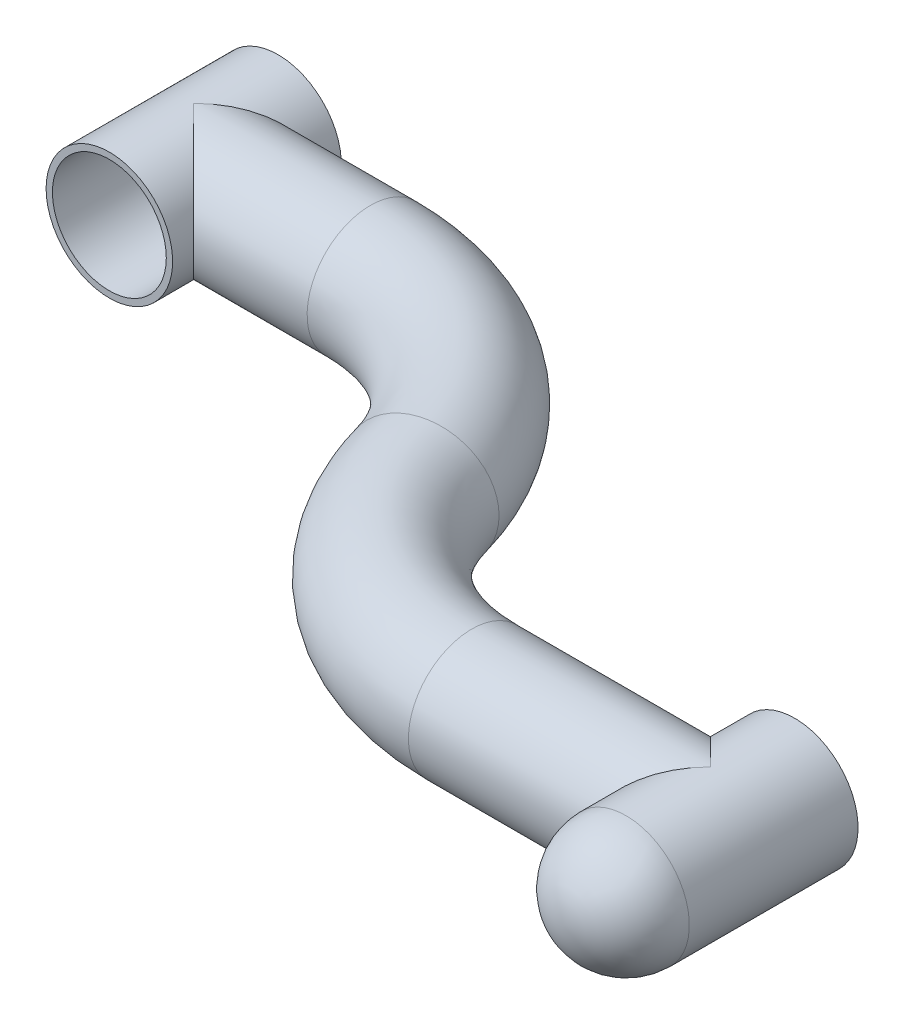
ISO-10303-21;
HEADER;
FILE_DESCRIPTION(('STEP AP214'),'2;1');
FILE_NAME('part.step','',(''),(''),'','','');
FILE_SCHEMA(('AUTOMOTIVE_DESIGN { 1 0 10303 214 1 1 1 1 }'));
ENDSEC;
DATA;
#1=APPLICATION_CONTEXT('core data for automotive mechanical design processes');
#2=APPLICATION_PROTOCOL_DEFINITION('international standard','automotive_design',2000,#1);
#3=PRODUCT_CONTEXT('',#1,'mechanical');
#4=PRODUCT('Part','Part','',(#3));
#5=PRODUCT_RELATED_PRODUCT_CATEGORY('part','',(#4));
#6=PRODUCT_DEFINITION_FORMATION('','',#4);
#7=PRODUCT_DEFINITION_CONTEXT('part definition',#1,'design');
#8=PRODUCT_DEFINITION('design','',#6,#7);
#9=PRODUCT_DEFINITION_SHAPE('','',#8);
#10=(LENGTH_UNIT() NAMED_UNIT(*) SI_UNIT(.MILLI.,.METRE.));
#11=(NAMED_UNIT(*) PLANE_ANGLE_UNIT() SI_UNIT($,.RADIAN.));
#12=(NAMED_UNIT(*) SI_UNIT($,.STERADIAN.) SOLID_ANGLE_UNIT());
#13=UNCERTAINTY_MEASURE_WITH_UNIT(LENGTH_MEASURE(1.E-05),#10,'distance_accuracy_value','');
#14=(GEOMETRIC_REPRESENTATION_CONTEXT(3) GLOBAL_UNCERTAINTY_ASSIGNED_CONTEXT((#13)) GLOBAL_UNIT_ASSIGNED_CONTEXT((#10,
#11,#12)) REPRESENTATION_CONTEXT('',''));
#15=CARTESIAN_POINT('',(0.,0.,0.));
#16=DIRECTION('',(0.,0.,1.));
#17=DIRECTION('',(1.,0.,0.));
#18=AXIS2_PLACEMENT_3D('',#15,#16,#17);
#19=CARTESIAN_POINT('',(-113.203482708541,0.,0.));
#20=DIRECTION('',(1.,0.,0.));
#21=DIRECTION('',(0.,0.,-1.));
#22=AXIS2_PLACEMENT_3D('',#19,#20,#21);
#23=CYLINDRICAL_SURFACE('',#22,30.);
#24=CARTESIAN_POINT('',(-113.203482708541,0.,0.));
#25=DIRECTION('',(1.,0.,0.));
#26=DIRECTION('',(0.,0.,-1.));
#27=AXIS2_PLACEMENT_3D('',#24,#25,#26);
#28=CIRCLE('',#27,30.);
#29=CARTESIAN_POINT('',(-113.203482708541,0.,-30.));
#30=VERTEX_POINT('',#29);
#31=EDGE_CURVE('E109',#30,#30,#28,.T.);
#32=ORIENTED_EDGE('',*,*,#31,.T.);
#33=EDGE_LOOP('',(#32));
#34=FACE_BOUND('',#33,.T.);
#35=CARTESIAN_POINT('',(0.,0.,0.));
#36=DIRECTION('',(0.707106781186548,0.,0.707106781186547));
#37=DIRECTION('',(0.707106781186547,0.,-0.707106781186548));
#38=AXIS2_PLACEMENT_3D('',#35,#36,#37);
#39=ELLIPSE('',#38,42.4264068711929,30.);
#40=CARTESIAN_POINT('',(0.,-30.,0.));
#41=VERTEX_POINT('',#40);
#42=CARTESIAN_POINT('',(0.,30.,0.));
#43=VERTEX_POINT('',#42);
#44=EDGE_CURVE('E75',#41,#43,#39,.F.);
#45=ORIENTED_EDGE('',*,*,#44,.T.);
#46=CARTESIAN_POINT('',(0.,0.,0.));
#47=DIRECTION('',(0.707106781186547,0.,-0.707106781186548));
#48=DIRECTION('',(0.707106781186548,0.,0.707106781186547));
#49=AXIS2_PLACEMENT_3D('',#46,#47,#48);
#50=ELLIPSE('',#49,42.4264068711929,30.);
#51=EDGE_CURVE('E62',#43,#41,#50,.F.);
#52=ORIENTED_EDGE('',*,*,#51,.T.);
#53=EDGE_LOOP('',(#45,#52));
#54=FACE_BOUND('',#53,.T.);
#55=ADVANCED_FACE('F38',(#34,#54),#23,.T.);
#56=CARTESIAN_POINT('',(-311.22362176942,0.,-150.));
#57=DIRECTION('',(-1.,0.,0.));
#58=DIRECTION('',(0.,0.,1.));
#59=AXIS2_PLACEMENT_3D('',#56,#57,#58);
#60=CYLINDRICAL_SURFACE('',#59,30.);
#61=CARTESIAN_POINT('',(-311.22362176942,0.,-150.));
#62=DIRECTION('',(1.,0.,0.));
#63=DIRECTION('',(0.,0.,-1.));
#64=AXIS2_PLACEMENT_3D('',#61,#62,#63);
#65=CIRCLE('',#64,30.);
#66=CARTESIAN_POINT('',(-311.22362176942,0.,-180.));
#67=VERTEX_POINT('',#66);
#68=EDGE_CURVE('E42',#67,#67,#65,.T.);
#69=ORIENTED_EDGE('',*,*,#68,.F.);
#70=EDGE_LOOP('',(#69));
#71=FACE_BOUND('',#70,.T.);
#72=CARTESIAN_POINT('',(-395.,0.,-150.));
#73=DIRECTION('',(-0.707106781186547,0.,0.707106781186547));
#74=DIRECTION('',(-0.707106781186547,0.,-0.707106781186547));
#75=AXIS2_PLACEMENT_3D('',#72,#73,#74);
#76=ELLIPSE('',#75,42.4264068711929,30.);
#77=CARTESIAN_POINT('',(-395.,30.,-150.));
#78=VERTEX_POINT('',#77);
#79=CARTESIAN_POINT('',(-395.,-30.,-150.));
#80=VERTEX_POINT('',#79);
#81=EDGE_CURVE('E67',#78,#80,#76,.F.);
#82=ORIENTED_EDGE('',*,*,#81,.T.);
#83=CARTESIAN_POINT('',(-395.,0.,-150.));
#84=DIRECTION('',(-0.707106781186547,0.,-0.707106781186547));
#85=DIRECTION('',(-0.707106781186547,0.,0.707106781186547));
#86=AXIS2_PLACEMENT_3D('',#83,#84,#85);
#87=ELLIPSE('',#86,42.4264068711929,30.);
#88=EDGE_CURVE('E55',#80,#78,#87,.F.);
#89=ORIENTED_EDGE('',*,*,#88,.T.);
#90=EDGE_LOOP('',(#82,#89));
#91=FACE_BOUND('',#90,.T.);
#92=ADVANCED_FACE('F40',(#71,#91),#60,.T.);
#93=CARTESIAN_POINT('',(-311.22362176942,0.,-47.14670754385));
#94=DIRECTION('',(0.,1.,0.));
#95=DIRECTION('',(0.,0.,1.));
#96=AXIS2_PLACEMENT_3D('',#93,#94,#95);
#97=TOROIDAL_SURFACE('',#96,102.85329245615,30.);
#98=CARTESIAN_POINT('',(-212.213552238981,0.,-74.9999999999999));
#99=DIRECTION('',(0.270806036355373,0.,0.962633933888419));
#100=DIRECTION('',(0.962633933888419,0.,-0.270806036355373));
#101=AXIS2_PLACEMENT_3D('',#98,#99,#100);
#102=CIRCLE('',#101,30.);
#103=CARTESIAN_POINT('',(-183.334534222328,0.,-83.1241810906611));
#104=VERTEX_POINT('',#103);
#105=EDGE_CURVE('E315',#104,#104,#102,.T.);
#106=CARTESIAN_POINT('',(-311.22362176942,0.,-47.14670754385));
#107=DIRECTION('',(0.,1.,0.));
#108=DIRECTION('',(0.,0.,1.));
#109=AXIS2_PLACEMENT_3D('',#106,#107,#108);
#110=CIRCLE('',#109,132.85329245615);
#111=EDGE_CURVE('',#104,#67,#110,.T.);
#112=ORIENTED_EDGE('',*,*,#105,.F.);
#113=ORIENTED_EDGE('',*,*,#68,.T.);
#114=ORIENTED_EDGE('',*,*,#111,.T.);
#115=ORIENTED_EDGE('',*,*,#111,.F.);
#116=EDGE_LOOP('',(#112,#114,#113,#115));
#117=FACE_BOUND('',#116,.T.);
#118=ADVANCED_FACE('F104',(#117),#97,.T.);
#119=CARTESIAN_POINT('',(-113.203482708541,0.,-102.85329245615));
#120=DIRECTION('',(0.,-1.,0.));
#121=DIRECTION('',(0.,0.,-1.));
#122=AXIS2_PLACEMENT_3D('',#119,#120,#121);
#123=TOROIDAL_SURFACE('',#122,102.85329245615,30.);
#124=ORIENTED_EDGE('',*,*,#31,.F.);
#125=EDGE_LOOP('',(#124));
#126=FACE_BOUND('',#125,.T.);
#127=ORIENTED_EDGE('',*,*,#105,.T.);
#128=EDGE_LOOP('',(#127));
#129=FACE_BOUND('',#128,.T.);
#130=ADVANCED_FACE('F238',(#126,#129),#123,.T.);
#131=CARTESIAN_POINT('',(0.,0.,-40.));
#132=DIRECTION('',(0.,0.,1.));
#133=DIRECTION('',(1.,0.,0.));
#134=AXIS2_PLACEMENT_3D('',#131,#132,#133);
#135=PLANE('',#134);
#136=CARTESIAN_POINT('',(0.,0.,-40.));
#137=DIRECTION('',(0.,0.,1.));
#138=DIRECTION('',(1.,0.,0.));
#139=AXIS2_PLACEMENT_3D('',#136,#137,#138);
#140=CIRCLE('',#139,27.);
#141=CARTESIAN_POINT('',(27.,0.,-40.));
#142=VERTEX_POINT('',#141);
#143=EDGE_CURVE('E128',#142,#142,#140,.T.);
#144=ORIENTED_EDGE('',*,*,#143,.T.);
#145=EDGE_LOOP('',(#144));
#146=FACE_BOUND('',#145,.T.);
#147=CARTESIAN_POINT('',(0.,0.,-40.));
#148=DIRECTION('',(0.,0.,-1.));
#149=DIRECTION('',(-1.,0.,0.));
#150=AXIS2_PLACEMENT_3D('',#147,#148,#149);
#151=CIRCLE('',#150,30.);
#152=CARTESIAN_POINT('',(-30.,0.,-40.));
#153=VERTEX_POINT('',#152);
#154=EDGE_CURVE('E72',#153,#153,#151,.T.);
#155=ORIENTED_EDGE('',*,*,#154,.T.);
#156=EDGE_LOOP('',(#155));
#157=FACE_BOUND('',#156,.T.);
#158=ADVANCED_FACE('F96',(#146,#157),#135,.F.);
#159=CARTESIAN_POINT('',(0.,0.,-40.));
#160=DIRECTION('',(0.,0.,-1.));
#161=DIRECTION('',(-1.,0.,0.));
#162=AXIS2_PLACEMENT_3D('',#159,#160,#161);
#163=CYLINDRICAL_SURFACE('',#162,30.);
#164=ORIENTED_EDGE('',*,*,#51,.F.);
#165=ORIENTED_EDGE('',*,*,#44,.F.);
#166=EDGE_LOOP('',(#164,#165));
#167=FACE_BOUND('',#166,.T.);
#168=ORIENTED_EDGE('',*,*,#154,.F.);
#169=EDGE_LOOP('',(#168));
#170=FACE_BOUND('',#169,.T.);
#171=CARTESIAN_POINT('',(0.,0.,40.));
#172=DIRECTION('',(0.,0.,-1.));
#173=DIRECTION('',(-1.,0.,0.));
#174=AXIS2_PLACEMENT_3D('',#171,#172,#173);
#175=CIRCLE('',#174,30.);
#176=CARTESIAN_POINT('',(-30.,0.,40.));
#177=VERTEX_POINT('',#176);
#178=EDGE_CURVE('E115',#177,#177,#175,.T.);
#179=ORIENTED_EDGE('',*,*,#178,.T.);
#180=EDGE_LOOP('',(#179));
#181=FACE_BOUND('',#180,.T.);
#182=ADVANCED_FACE('F92',(#167,#170,#181),#163,.T.);
#183=CARTESIAN_POINT('',(-395.,0.,-190.));
#184=DIRECTION('',(0.,0.,-1.));
#185=DIRECTION('',(-1.,0.,0.));
#186=AXIS2_PLACEMENT_3D('',#183,#184,#185);
#187=CYLINDRICAL_SURFACE('',#186,30.);
#188=CARTESIAN_POINT('',(-395.,0.,-110.));
#189=DIRECTION('',(0.,0.,-1.));
#190=DIRECTION('',(-1.,0.,0.));
#191=AXIS2_PLACEMENT_3D('',#188,#189,#190);
#192=CIRCLE('',#191,30.);
#193=CARTESIAN_POINT('',(-425.,0.,-110.));
#194=VERTEX_POINT('',#193);
#195=EDGE_CURVE('E70',#194,#194,#192,.T.);
#196=ORIENTED_EDGE('',*,*,#195,.T.);
#197=EDGE_LOOP('',(#196));
#198=FACE_BOUND('',#197,.T.);
#199=CARTESIAN_POINT('',(-395.,0.,-190.));
#200=DIRECTION('',(0.,0.,-1.));
#201=DIRECTION('',(-1.,0.,0.));
#202=AXIS2_PLACEMENT_3D('',#199,#200,#201);
#203=CIRCLE('',#202,30.);
#204=CARTESIAN_POINT('',(-425.,0.,-190.));
#205=VERTEX_POINT('',#204);
#206=EDGE_CURVE('E131',#205,#205,#203,.T.);
#207=ORIENTED_EDGE('',*,*,#206,.F.);
#208=EDGE_LOOP('',(#207));
#209=FACE_BOUND('',#208,.T.);
#210=ORIENTED_EDGE('',*,*,#88,.F.);
#211=ORIENTED_EDGE('',*,*,#81,.F.);
#212=EDGE_LOOP('',(#210,#211));
#213=FACE_BOUND('',#212,.T.);
#214=ADVANCED_FACE('F68',(#198,#209,#213),#187,.T.);
#215=CARTESIAN_POINT('',(-395.,0.,-110.));
#216=DIRECTION('',(0.,0.,1.));
#217=DIRECTION('',(1.,0.,0.));
#218=AXIS2_PLACEMENT_3D('',#215,#216,#217);
#219=PLANE('',#218);
#220=CARTESIAN_POINT('',(-395.,0.,-110.));
#221=DIRECTION('',(0.,0.,1.));
#222=DIRECTION('',(1.,0.,0.));
#223=AXIS2_PLACEMENT_3D('',#220,#221,#222);
#224=CIRCLE('',#223,27.);
#225=CARTESIAN_POINT('',(-368.,0.,-110.));
#226=VERTEX_POINT('',#225);
#227=EDGE_CURVE('E125',#226,#226,#224,.T.);
#228=ORIENTED_EDGE('',*,*,#227,.F.);
#229=EDGE_LOOP('',(#228));
#230=FACE_BOUND('',#229,.T.);
#231=ORIENTED_EDGE('',*,*,#195,.F.);
#232=EDGE_LOOP('',(#231));
#233=FACE_BOUND('',#232,.T.);
#234=ADVANCED_FACE('F149',(#230,#233),#219,.T.);
#235=CARTESIAN_POINT('',(-395.,0.,-190.));
#236=DIRECTION('',(0.,0.,-1.));
#237=DIRECTION('',(-1.,0.,0.));
#238=AXIS2_PLACEMENT_3D('',#235,#236,#237);
#239=PLANE('',#238);
#240=CARTESIAN_POINT('',(-395.,0.,-190.));
#241=DIRECTION('',(0.,0.,1.));
#242=DIRECTION('',(1.,0.,0.));
#243=AXIS2_PLACEMENT_3D('',#240,#241,#242);
#244=CIRCLE('',#243,27.);
#245=CARTESIAN_POINT('',(-368.,0.,-190.));
#246=VERTEX_POINT('',#245);
#247=EDGE_CURVE('E120',#246,#246,#244,.T.);
#248=ORIENTED_EDGE('',*,*,#247,.T.);
#249=EDGE_LOOP('',(#248));
#250=FACE_BOUND('',#249,.T.);
#251=ORIENTED_EDGE('',*,*,#206,.T.);
#252=EDGE_LOOP('',(#251));
#253=FACE_BOUND('',#252,.T.);
#254=ADVANCED_FACE('F147',(#250,#253),#239,.T.);
#255=CARTESIAN_POINT('',(0.,0.,-190.));
#256=DIRECTION('',(0.,0.,1.));
#257=DIRECTION('',(1.,0.,0.));
#258=AXIS2_PLACEMENT_3D('',#255,#256,#257);
#259=CYLINDRICAL_SURFACE('',#258,27.);
#260=CARTESIAN_POINT('',(0.,0.,40.));
#261=DIRECTION('',(0.,0.,-1.));
#262=DIRECTION('',(-1.,0.,0.));
#263=AXIS2_PLACEMENT_3D('',#260,#261,#262);
#264=CIRCLE('',#263,27.);
#265=CARTESIAN_POINT('',(27.,0.,40.));
#266=VERTEX_POINT('',#265);
#267=EDGE_CURVE('E117',#266,#266,#264,.F.);
#268=CARTESIAN_POINT('',(27.,0.,40.));
#269=CARTESIAN_POINT('',(27.,0.,39.1666666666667));
#270=CARTESIAN_POINT('',(27.,0.,38.3333333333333));
#271=CARTESIAN_POINT('',(27.,0.,36.6666666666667));
#272=CARTESIAN_POINT('',(27.,0.,35.8333333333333));
#273=CARTESIAN_POINT('',(27.,0.,34.1666666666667));
#274=CARTESIAN_POINT('',(27.,0.,33.3333333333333));
#275=CARTESIAN_POINT('',(27.,0.,31.6666666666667));
#276=CARTESIAN_POINT('',(27.,0.,30.8333333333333));
#277=CARTESIAN_POINT('',(27.,0.,29.1666666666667));
#278=CARTESIAN_POINT('',(27.,0.,28.3333333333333));
#279=CARTESIAN_POINT('',(27.,0.,26.6666666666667));
#280=CARTESIAN_POINT('',(27.,0.,25.8333333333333));
#281=CARTESIAN_POINT('',(27.,0.,24.1666666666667));
#282=CARTESIAN_POINT('',(27.,0.,23.3333333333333));
#283=CARTESIAN_POINT('',(27.,0.,21.6666666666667));
#284=CARTESIAN_POINT('',(27.,0.,20.8333333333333));
#285=CARTESIAN_POINT('',(27.,0.,19.1666666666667));
#286=CARTESIAN_POINT('',(27.,0.,18.3333333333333));
#287=CARTESIAN_POINT('',(27.,0.,16.6666666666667));
#288=CARTESIAN_POINT('',(27.,0.,15.8333333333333));
#289=CARTESIAN_POINT('',(27.,0.,14.1666666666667));
#290=CARTESIAN_POINT('',(27.,0.,13.3333333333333));
#291=CARTESIAN_POINT('',(27.,0.,11.6666666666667));
#292=CARTESIAN_POINT('',(27.,0.,10.8333333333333));
#293=CARTESIAN_POINT('',(27.,0.,9.16666666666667));
#294=CARTESIAN_POINT('',(27.,0.,8.33333333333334));
#295=CARTESIAN_POINT('',(27.,0.,6.66666666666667));
#296=CARTESIAN_POINT('',(27.,0.,5.83333333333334));
#297=CARTESIAN_POINT('',(27.,0.,4.16666666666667));
#298=CARTESIAN_POINT('',(27.,0.,3.33333333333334));
#299=CARTESIAN_POINT('',(27.,0.,1.66666666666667));
#300=CARTESIAN_POINT('',(27.,0.,0.833333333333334));
#301=CARTESIAN_POINT('',(27.,0.,-0.833333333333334));
#302=CARTESIAN_POINT('',(27.,0.,-1.66666666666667));
#303=CARTESIAN_POINT('',(27.,0.,-3.33333333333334));
#304=CARTESIAN_POINT('',(27.,0.,-4.16666666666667));
#305=CARTESIAN_POINT('',(27.,0.,-5.83333333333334));
#306=CARTESIAN_POINT('',(27.,0.,-6.66666666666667));
#307=CARTESIAN_POINT('',(27.,0.,-8.33333333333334));
#308=CARTESIAN_POINT('',(27.,0.,-9.16666666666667));
#309=CARTESIAN_POINT('',(27.,0.,-10.8333333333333));
#310=CARTESIAN_POINT('',(27.,0.,-11.6666666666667));
#311=CARTESIAN_POINT('',(27.,0.,-13.3333333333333));
#312=CARTESIAN_POINT('',(27.,0.,-14.1666666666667));
#313=CARTESIAN_POINT('',(27.,0.,-15.8333333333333));
#314=CARTESIAN_POINT('',(27.,0.,-16.6666666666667));
#315=CARTESIAN_POINT('',(27.,0.,-18.3333333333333));
#316=CARTESIAN_POINT('',(27.,0.,-19.1666666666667));
#317=CARTESIAN_POINT('',(27.,0.,-20.8333333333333));
#318=CARTESIAN_POINT('',(27.,0.,-21.6666666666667));
#319=CARTESIAN_POINT('',(27.,0.,-23.3333333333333));
#320=CARTESIAN_POINT('',(27.,0.,-24.1666666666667));
#321=CARTESIAN_POINT('',(27.,0.,-25.8333333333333));
#322=CARTESIAN_POINT('',(27.,0.,-26.6666666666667));
#323=CARTESIAN_POINT('',(27.,0.,-28.3333333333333));
#324=CARTESIAN_POINT('',(27.,0.,-29.1666666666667));
#325=CARTESIAN_POINT('',(27.,0.,-30.8333333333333));
#326=CARTESIAN_POINT('',(27.,0.,-31.6666666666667));
#327=CARTESIAN_POINT('',(27.,0.,-33.3333333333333));
#328=CARTESIAN_POINT('',(27.,0.,-34.1666666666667));
#329=CARTESIAN_POINT('',(27.,0.,-35.8333333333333));
#330=CARTESIAN_POINT('',(27.,0.,-36.6666666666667));
#331=CARTESIAN_POINT('',(27.,0.,-38.3333333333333));
#332=CARTESIAN_POINT('',(27.,0.,-39.1666666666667));
#333=CARTESIAN_POINT('',(27.,0.,-40.));
#334=B_SPLINE_CURVE_WITH_KNOTS('',3,(#268,#269,#270,#271,#272,#273,#274,#275,#276,#277,#278,
#279,#280,#281,#282,#283,#284,#285,#286,#287,#288,#289,#290,#291,#292,#293,#294,#295,#296,#297,
#298,#299,#300,#301,#302,#303,#304,#305,#306,#307,#308,#309,#310,#311,#312,#313,#314,#315,#316,
#317,#318,#319,#320,#321,#322,#323,#324,#325,#326,#327,#328,#329,#330,#331,#332,#333),
.UNSPECIFIED.,.F.,.F.,(4,2,2,2,2,2,2,2,2,2,2,2,2,2,2,2,2,2,2,2,2,2,2,2,2,2,2,2,2,2,2,2,4),(0.,
2.5,5.,7.50000000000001,10.,12.5,15.,17.5,20.,22.5,25.,27.5,30.,32.5,35.,37.5,40.,42.5,45.,47.5,
50.,52.5,55.,57.5,60.,62.5,65.,67.5,70.,72.5,75.,77.5,80.),.UNSPECIFIED.);
#335=EDGE_CURVE('BSEAM156',#266,#142,#334,.T.);
#336=ORIENTED_EDGE('',*,*,#267,.T.);
#337=ORIENTED_EDGE('',*,*,#143,.F.);
#338=ORIENTED_EDGE('',*,*,#335,.T.);
#339=ORIENTED_EDGE('',*,*,#335,.F.);
#340=EDGE_LOOP('',(#336,#338,#337,#339));
#341=FACE_BOUND('',#340,.T.);
#342=ADVANCED_FACE('F156',(#341),#259,.F.);
#343=CARTESIAN_POINT('',(-395.,0.,-190.));
#344=DIRECTION('',(0.,0.,1.));
#345=DIRECTION('',(1.,0.,0.));
#346=AXIS2_PLACEMENT_3D('',#343,#344,#345);
#347=CYLINDRICAL_SURFACE('',#346,27.);
#348=CARTESIAN_POINT('',(-368.,0.,-110.));
#349=CARTESIAN_POINT('',(-368.,0.,-110.833333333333));
#350=CARTESIAN_POINT('',(-368.,0.,-111.666666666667));
#351=CARTESIAN_POINT('',(-368.,0.,-113.333333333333));
#352=CARTESIAN_POINT('',(-368.,0.,-114.166666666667));
#353=CARTESIAN_POINT('',(-368.,0.,-115.833333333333));
#354=CARTESIAN_POINT('',(-368.,0.,-116.666666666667));
#355=CARTESIAN_POINT('',(-368.,0.,-118.333333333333));
#356=CARTESIAN_POINT('',(-368.,0.,-119.166666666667));
#357=CARTESIAN_POINT('',(-368.,0.,-120.833333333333));
#358=CARTESIAN_POINT('',(-368.,0.,-121.666666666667));
#359=CARTESIAN_POINT('',(-368.,0.,-123.333333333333));
#360=CARTESIAN_POINT('',(-368.,0.,-124.166666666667));
#361=CARTESIAN_POINT('',(-368.,0.,-125.833333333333));
#362=CARTESIAN_POINT('',(-368.,0.,-126.666666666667));
#363=CARTESIAN_POINT('',(-368.,0.,-128.333333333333));
#364=CARTESIAN_POINT('',(-368.,0.,-129.166666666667));
#365=CARTESIAN_POINT('',(-368.,0.,-130.833333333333));
#366=CARTESIAN_POINT('',(-368.,0.,-131.666666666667));
#367=CARTESIAN_POINT('',(-368.,0.,-133.333333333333));
#368=CARTESIAN_POINT('',(-368.,0.,-134.166666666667));
#369=CARTESIAN_POINT('',(-368.,0.,-135.833333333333));
#370=CARTESIAN_POINT('',(-368.,0.,-136.666666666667));
#371=CARTESIAN_POINT('',(-368.,0.,-138.333333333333));
#372=CARTESIAN_POINT('',(-368.,0.,-139.166666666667));
#373=CARTESIAN_POINT('',(-368.,0.,-140.833333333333));
#374=CARTESIAN_POINT('',(-368.,0.,-141.666666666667));
#375=CARTESIAN_POINT('',(-368.,0.,-143.333333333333));
#376=CARTESIAN_POINT('',(-368.,0.,-144.166666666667));
#377=CARTESIAN_POINT('',(-368.,0.,-145.833333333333));
#378=CARTESIAN_POINT('',(-368.,0.,-146.666666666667));
#379=CARTESIAN_POINT('',(-368.,0.,-148.333333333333));
#380=CARTESIAN_POINT('',(-368.,0.,-149.166666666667));
#381=CARTESIAN_POINT('',(-368.,0.,-150.833333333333));
#382=CARTESIAN_POINT('',(-368.,0.,-151.666666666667));
#383=CARTESIAN_POINT('',(-368.,0.,-153.333333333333));
#384=CARTESIAN_POINT('',(-368.,0.,-154.166666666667));
#385=CARTESIAN_POINT('',(-368.,0.,-155.833333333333));
#386=CARTESIAN_POINT('',(-368.,0.,-156.666666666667));
#387=CARTESIAN_POINT('',(-368.,0.,-158.333333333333));
#388=CARTESIAN_POINT('',(-368.,0.,-159.166666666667));
#389=CARTESIAN_POINT('',(-368.,0.,-160.833333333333));
#390=CARTESIAN_POINT('',(-368.,0.,-161.666666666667));
#391=CARTESIAN_POINT('',(-368.,0.,-163.333333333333));
#392=CARTESIAN_POINT('',(-368.,0.,-164.166666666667));
#393=CARTESIAN_POINT('',(-368.,0.,-165.833333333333));
#394=CARTESIAN_POINT('',(-368.,0.,-166.666666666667));
#395=CARTESIAN_POINT('',(-368.,0.,-168.333333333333));
#396=CARTESIAN_POINT('',(-368.,0.,-169.166666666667));
#397=CARTESIAN_POINT('',(-368.,0.,-170.833333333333));
#398=CARTESIAN_POINT('',(-368.,0.,-171.666666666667));
#399=CARTESIAN_POINT('',(-368.,0.,-173.333333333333));
#400=CARTESIAN_POINT('',(-368.,0.,-174.166666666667));
#401=CARTESIAN_POINT('',(-368.,0.,-175.833333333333));
#402=CARTESIAN_POINT('',(-368.,0.,-176.666666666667));
#403=CARTESIAN_POINT('',(-368.,0.,-178.333333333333));
#404=CARTESIAN_POINT('',(-368.,0.,-179.166666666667));
#405=CARTESIAN_POINT('',(-368.,0.,-180.833333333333));
#406=CARTESIAN_POINT('',(-368.,0.,-181.666666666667));
#407=CARTESIAN_POINT('',(-368.,0.,-183.333333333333));
#408=CARTESIAN_POINT('',(-368.,0.,-184.166666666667));
#409=CARTESIAN_POINT('',(-368.,0.,-185.833333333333));
#410=CARTESIAN_POINT('',(-368.,0.,-186.666666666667));
#411=CARTESIAN_POINT('',(-368.,0.,-188.333333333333));
#412=CARTESIAN_POINT('',(-368.,0.,-189.166666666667));
#413=CARTESIAN_POINT('',(-368.,0.,-190.));
#414=B_SPLINE_CURVE_WITH_KNOTS('',3,(#348,#349,#350,#351,#352,#353,#354,#355,#356,#357,#358,
#359,#360,#361,#362,#363,#364,#365,#366,#367,#368,#369,#370,#371,#372,#373,#374,#375,#376,#377,
#378,#379,#380,#381,#382,#383,#384,#385,#386,#387,#388,#389,#390,#391,#392,#393,#394,#395,#396,
#397,#398,#399,#400,#401,#402,#403,#404,#405,#406,#407,#408,#409,#410,#411,#412,#413),
.UNSPECIFIED.,.F.,.F.,(4,2,2,2,2,2,2,2,2,2,2,2,2,2,2,2,2,2,2,2,2,2,2,2,2,2,2,2,2,2,2,2,4),(0.,
2.5,5.,7.49999999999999,9.99999999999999,12.5,15.,17.5,20.,22.5,25.,27.5,30.,32.5,35.,37.5,40.,
42.5,45.,47.5,50.,52.5,55.,57.5,60.,62.5,65.,67.5,70.,72.5,75.,77.5,79.9999999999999),.UNSPECIFIED.);
#415=EDGE_CURVE('BSEAM166',#226,#246,#414,.T.);
#416=ORIENTED_EDGE('',*,*,#227,.T.);
#417=ORIENTED_EDGE('',*,*,#247,.F.);
#418=ORIENTED_EDGE('',*,*,#415,.T.);
#419=ORIENTED_EDGE('',*,*,#415,.F.);
#420=EDGE_LOOP('',(#416,#418,#417,#419));
#421=FACE_BOUND('',#420,.T.);
#422=ADVANCED_FACE('F166',(#421),#347,.F.);
#423=CARTESIAN_POINT('',(-30.,0.,40.));
#424=DIRECTION('',(0.,0.,-1.));
#425=DIRECTION('',(-1.,0.,0.));
#426=AXIS2_PLACEMENT_3D('',#423,#424,#425);
#427=PLANE('',#426);
#428=ORIENTED_EDGE('',*,*,#267,.F.);
#429=EDGE_LOOP('',(#428));
#430=FACE_BOUND('',#429,.T.);
#431=ADVANCED_FACE('F169',(#430),#427,.T.);
#432=CARTESIAN_POINT('',(0.,0.,40.));
#433=DIRECTION('',(0.,0.,-1.));
#434=DIRECTION('',(-1.,0.,0.));
#435=AXIS2_PLACEMENT_3D('',#432,#433,#434);
#436=SPHERICAL_SURFACE('',#435,30.);
#437=ORIENTED_EDGE('',*,*,#178,.F.);
#438=EDGE_LOOP('',(#437));
#439=FACE_BOUND('',#438,.T.);
#440=ADVANCED_FACE('F176',(#439),#436,.T.);
#441=CLOSED_SHELL('',(#55,#92,#118,#130,#158,#182,#214,#234,#254,#342,#422,#431,#440));
#442=CARTESIAN_POINT('',(-365.,0.,-123.));
#443=CARTESIAN_POINT('',(-365.000005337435,-0.625774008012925,-123.000005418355));
#444=CARTESIAN_POINT('',(-365.019622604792,-1.25163798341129,-123.021797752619));
#445=CARTESIAN_POINT('',(-365.097655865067,-2.4979836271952,-123.108541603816));
#446=CARTESIAN_POINT('',(-365.15607939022,-3.11846422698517,-123.173501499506));
#447=CARTESIAN_POINT('',(-365.310469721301,-4.34934840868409,-123.345363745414));
#448=CARTESIAN_POINT('',(-365.406467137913,-4.95974335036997,-123.45230029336));
#449=CARTESIAN_POINT('',(-365.633950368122,-6.16534685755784,-123.706121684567));
#450=CARTESIAN_POINT('',(-365.765435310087,-6.76055579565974,-123.853005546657));
#451=CARTESIAN_POINT('',(-366.060337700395,-7.92819257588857,-124.183154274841));
#452=CARTESIAN_POINT('',(-366.223542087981,-8.50074332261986,-124.366176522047));
#453=CARTESIAN_POINT('',(-366.579542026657,-9.62417911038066,-124.766474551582));
#454=CARTESIAN_POINT('',(-366.772337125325,-10.1750644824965,-124.983749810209));
#455=CARTESIAN_POINT('',(-367.184504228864,-11.2530565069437,-125.449773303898));
#456=CARTESIAN_POINT('',(-367.403879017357,-11.7801606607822,-125.698524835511));
#457=CARTESIAN_POINT('',(-367.86619841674,-12.8091780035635,-126.224823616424));
#458=CARTESIAN_POINT('',(-368.109148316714,-13.3110855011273,-126.502377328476));
#459=CARTESIAN_POINT('',(-368.539174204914,-14.1411644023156,-126.995973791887));
#460=CARTESIAN_POINT('',(-368.721005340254,-14.4760839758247,-127.205324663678));
#461=CARTESIAN_POINT('',(-369.093648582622,-15.1328615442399,-127.635951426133));
#462=CARTESIAN_POINT('',(-369.284458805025,-15.4547222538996,-127.857224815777));
#463=CARTESIAN_POINT('',(-369.869142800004,-16.4009074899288,-128.538074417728));
#464=CARTESIAN_POINT('',(-370.275194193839,-17.0056904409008,-129.014593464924));
#465=CARTESIAN_POINT('',(-371.113055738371,-18.1638668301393,-130.008556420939));
#466=CARTESIAN_POINT('',(-371.544918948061,-18.7171479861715,-130.526085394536));
#467=CARTESIAN_POINT('',(-372.426567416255,-19.77149881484,-131.597483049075));
#468=CARTESIAN_POINT('',(-372.876350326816,-20.2725752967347,-132.15134697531));
#469=CARTESIAN_POINT('',(-373.797349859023,-21.2344359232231,-133.306384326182));
#470=CARTESIAN_POINT('',(-374.268821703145,-21.6940092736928,-133.908359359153));
#471=CARTESIAN_POINT('',(-375.215045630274,-22.56028987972,-135.14722262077));
#472=CARTESIAN_POINT('',(-375.689798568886,-22.9669827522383,-135.784120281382));
#473=CARTESIAN_POINT('',(-376.396230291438,-23.5370203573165,-136.765527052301));
#474=CARTESIAN_POINT('',(-376.630573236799,-23.7202356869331,-137.096731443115));
#475=CARTESIAN_POINT('',(-377.095968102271,-24.0734479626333,-137.768356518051));
#476=CARTESIAN_POINT('',(-377.327020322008,-24.2434461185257,-138.1087763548));
#477=CARTESIAN_POINT('',(-377.783941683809,-24.5700256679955,-138.79912603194));
#478=CARTESIAN_POINT('',(-378.009813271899,-24.7266134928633,-139.149051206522));
#479=CARTESIAN_POINT('',(-378.454289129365,-25.026211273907,-139.85913067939));
#480=CARTESIAN_POINT('',(-378.67289440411,-25.1692231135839,-140.219283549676));
#481=CARTESIAN_POINT('',(-379.099488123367,-25.4408615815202,-140.949377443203));
#482=CARTESIAN_POINT('',(-379.307509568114,-25.5695346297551,-141.319281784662));
#483=CARTESIAN_POINT('',(-379.710423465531,-25.8124809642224,-142.070827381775));
#484=CARTESIAN_POINT('',(-379.905316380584,-25.9267547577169,-142.452468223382));
#485=CARTESIAN_POINT('',(-380.277774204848,-26.1400476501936,-143.228031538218));
#486=CARTESIAN_POINT('',(-380.45534978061,-26.2390761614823,-143.621946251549));
#487=CARTESIAN_POINT('',(-380.788282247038,-26.4208830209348,-144.422774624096));
#488=CARTESIAN_POINT('',(-380.943642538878,-26.503663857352,-144.829686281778));
#489=CARTESIAN_POINT('',(-381.202359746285,-26.639120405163,-145.586497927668));
#490=CARTESIAN_POINT('',(-381.310068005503,-26.6945195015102,-145.934414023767));
#491=CARTESIAN_POINT('',(-381.502362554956,-26.7922645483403,-146.638343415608));
#492=CARTESIAN_POINT('',(-381.586956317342,-26.8346147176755,-146.994354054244));
#493=CARTESIAN_POINT('',(-381.729351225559,-26.9053197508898,-147.712306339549));
#494=CARTESIAN_POINT('',(-381.787211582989,-26.9337055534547,-148.074233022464));
#495=CARTESIAN_POINT('',(-381.873557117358,-26.975893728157,-148.802450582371));
#496=CARTESIAN_POINT('',(-381.902044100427,-26.9896969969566,-149.16874118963));
#497=CARTESIAN_POINT('',(-381.928154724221,-27.0023534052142,-149.904707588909));
#498=CARTESIAN_POINT('',(-381.925608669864,-27.0011243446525,-150.274390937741));
#499=CARTESIAN_POINT('',(-381.889387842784,-26.9835548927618,-151.011846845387));
#500=CARTESIAN_POINT('',(-381.855712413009,-26.9672141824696,-151.379619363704));
#501=CARTESIAN_POINT('',(-381.758985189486,-26.9198512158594,-152.110965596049));
#502=CARTESIAN_POINT('',(-381.695878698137,-26.8888016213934,-152.474530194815));
#503=CARTESIAN_POINT('',(-381.54335217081,-26.8127927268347,-153.194575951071));
#504=CARTESIAN_POINT('',(-381.453927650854,-26.7678310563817,-153.551055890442));
#505=CARTESIAN_POINT('',(-381.209249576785,-26.6428459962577,-154.406507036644));
#506=CARTESIAN_POINT('',(-381.04220547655,-26.5560534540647,-154.901115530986));
#507=CARTESIAN_POINT('',(-380.672524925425,-26.3584391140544,-155.871835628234));
#508=CARTESIAN_POINT('',(-380.469868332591,-26.2476037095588,-156.347936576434));
#509=CARTESIAN_POINT('',(-380.037408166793,-26.0035136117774,-157.283671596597));
#510=CARTESIAN_POINT('',(-379.80751203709,-25.870181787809,-157.743242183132));
#511=CARTESIAN_POINT('',(-379.328472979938,-25.5828315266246,-158.645394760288));
#512=CARTESIAN_POINT('',(-379.079331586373,-25.4288147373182,-159.087978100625));
#513=CARTESIAN_POINT('',(-378.586394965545,-25.1132000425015,-159.925331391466));
#514=CARTESIAN_POINT('',(-378.343574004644,-24.9530119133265,-160.321212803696));
#515=CARTESIAN_POINT('',(-377.849658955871,-24.6161569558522,-161.100680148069));
#516=CARTESIAN_POINT('',(-377.598563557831,-24.439487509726,-161.484264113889));
#517=CARTESIAN_POINT('',(-377.090751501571,-24.069846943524,-162.240079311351));
#518=CARTESIAN_POINT('',(-376.834031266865,-23.8768652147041,-162.612302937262));
#519=CARTESIAN_POINT('',(-376.317415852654,-23.4748417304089,-163.345660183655));
#520=CARTESIAN_POINT('',(-376.057520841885,-23.2658008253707,-163.706794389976));
#521=CARTESIAN_POINT('',(-375.536458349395,-22.8316781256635,-164.41832666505));
#522=CARTESIAN_POINT('',(-375.275290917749,-22.6065969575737,-164.768725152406));
#523=CARTESIAN_POINT('',(-374.753322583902,-22.1403388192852,-165.458939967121));
#524=CARTESIAN_POINT('',(-374.492521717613,-21.8991603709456,-165.798755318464));
#525=CARTESIAN_POINT('',(-373.713173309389,-21.151566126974,-166.801995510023));
#526=CARTESIAN_POINT('',(-373.197330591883,-20.6208039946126,-167.449685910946));
#527=CARTESIAN_POINT('',(-372.25641569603,-19.5742568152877,-168.610980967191));
#528=CARTESIAN_POINT('',(-371.828916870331,-19.0671958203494,-169.130510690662));
#529=CARTESIAN_POINT('',(-370.993523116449,-18.0040576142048,-170.134259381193));
#530=CARTESIAN_POINT('',(-370.585629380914,-17.4479774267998,-170.618476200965));
#531=CARTESIAN_POINT('',(-369.796604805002,-16.2874241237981,-171.546944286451));
#532=CARTESIAN_POINT('',(-369.415428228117,-15.6830376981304,-171.991264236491));
#533=CARTESIAN_POINT('',(-368.868433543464,-14.7401931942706,-172.624544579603));
#534=CARTESIAN_POINT('',(-368.690242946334,-14.419893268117,-172.830090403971));
#535=CARTESIAN_POINT('',(-368.342899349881,-13.7671957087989,-173.229523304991));
#536=CARTESIAN_POINT('',(-368.173748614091,-13.4347950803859,-173.423407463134));
#537=CARTESIAN_POINT('',(-367.756635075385,-12.5751623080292,-173.900221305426));
#538=CARTESIAN_POINT('',(-367.515523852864,-12.03978472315,-174.174599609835));
#539=CARTESIAN_POINT('',(-367.060523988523,-10.942502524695,-174.690668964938));
#540=CARTESIAN_POINT('',(-366.84662898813,-10.3806041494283,-174.932367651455));
#541=CARTESIAN_POINT('',(-366.449474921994,-9.23235504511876,-175.379975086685));
#542=CARTESIAN_POINT('',(-366.266207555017,-8.64601099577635,-175.585893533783));
#543=CARTESIAN_POINT('',(-365.933576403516,-7.45166043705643,-175.958892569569));
#544=CARTESIAN_POINT('',(-365.784213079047,-6.84365363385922,-176.125972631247));
#545=CARTESIAN_POINT('',(-365.521434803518,-5.60516361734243,-176.419502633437));
#546=CARTESIAN_POINT('',(-365.408300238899,-4.97454520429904,-176.545635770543));
#547=CARTESIAN_POINT('',(-365.222089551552,-3.70009505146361,-176.753056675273));
#548=CARTESIAN_POINT('',(-365.149013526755,-3.05626327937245,-176.834344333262));
#549=CARTESIAN_POINT('',(-365.044710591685,-1.76134663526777,-176.950324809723));
#550=CARTESIAN_POINT('',(-365.013463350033,-1.11026544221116,-176.985040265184));
#551=CARTESIAN_POINT('',(-364.993543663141,0.193318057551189,-177.007174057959));
#552=CARTESIAN_POINT('',(-365.004866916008,0.845820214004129,-176.994597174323));
#553=CARTESIAN_POINT('',(-365.065949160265,2.06943823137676,-176.92670746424));
#554=CARTESIAN_POINT('',(-365.111025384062,2.64109041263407,-176.876601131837));
#555=CARTESIAN_POINT('',(-365.233186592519,3.77661597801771,-176.740681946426));
#556=CARTESIAN_POINT('',(-365.310268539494,4.34049009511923,-176.654872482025));
#557=CARTESIAN_POINT('',(-365.49503174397,5.45683227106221,-176.448917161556));
#558=CARTESIAN_POINT('',(-365.602714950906,6.00929960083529,-176.328769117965));
#559=CARTESIAN_POINT('',(-365.846829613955,7.09963507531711,-176.055921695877));
#560=CARTESIAN_POINT('',(-365.983262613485,7.63750243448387,-175.903220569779));
#561=CARTESIAN_POINT('',(-366.286386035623,8.70895637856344,-175.563209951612));
#562=CARTESIAN_POINT('',(-366.453735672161,9.24211548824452,-175.375144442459));
#563=CARTESIAN_POINT('',(-366.813822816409,10.288119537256,-174.969367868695));
#564=CARTESIAN_POINT('',(-367.006559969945,10.8009647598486,-174.751657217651));
#565=CARTESIAN_POINT('',(-367.414869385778,11.804841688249,-174.288912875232));
#566=CARTESIAN_POINT('',(-367.63044611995,12.295869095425,-174.043873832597));
#567=CARTESIAN_POINT('',(-368.081878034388,13.2550262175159,-173.528720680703));
#568=CARTESIAN_POINT('',(-368.317737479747,13.7231510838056,-173.258601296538));
#569=CARTESIAN_POINT('',(-368.745851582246,14.5213739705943,-172.766009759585));
#570=CARTESIAN_POINT('',(-368.934230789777,14.8566750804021,-172.54854992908));
#571=CARTESIAN_POINT('',(-369.319878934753,15.5137519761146,-172.101614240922));
#572=CARTESIAN_POINT('',(-369.51714635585,15.8355300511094,-171.872140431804));
#573=CARTESIAN_POINT('',(-370.121029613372,16.7808218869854,-171.166543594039));
#574=CARTESIAN_POINT('',(-370.539632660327,17.3841201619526,-170.673352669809));
#575=CARTESIAN_POINT('',(-371.402030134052,18.5379653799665,-169.645424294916));
#576=CARTESIAN_POINT('',(-371.845887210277,19.088371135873,-169.110582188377));
#577=CARTESIAN_POINT('',(-372.750404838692,20.135388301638,-168.004060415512));
#578=CARTESIAN_POINT('',(-373.211062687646,20.6320083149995,-167.432386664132));
#579=CARTESIAN_POINT('',(-374.152341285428,21.5831656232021,-166.24073908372));
#580=CARTESIAN_POINT('',(-374.633177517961,22.0364736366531,-165.619957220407));
#581=CARTESIAN_POINT('',(-375.595817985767,22.888655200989,-164.342232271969));
#582=CARTESIAN_POINT('',(-376.077622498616,23.2875098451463,-163.685276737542));
#583=CARTESIAN_POINT('',(-376.791807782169,23.8443466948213,-162.67260298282));
#584=CARTESIAN_POINT('',(-377.028209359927,24.0228882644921,-162.330872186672));
#585=CARTESIAN_POINT('',(-377.496625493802,24.3662908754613,-161.637593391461));
#586=CARTESIAN_POINT('',(-377.728639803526,24.5311511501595,-161.286044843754));
#587=CARTESIAN_POINT('',(-378.186002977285,24.8468644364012,-160.572856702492));
#588=CARTESIAN_POINT('',(-378.411356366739,24.9977271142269,-160.211224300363));
#589=CARTESIAN_POINT('',(-378.852960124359,25.2852225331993,-159.47696949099));
#590=CARTESIAN_POINT('',(-379.069212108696,25.421857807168,-159.10434905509));
#591=CARTESIAN_POINT('',(-379.477686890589,25.6731774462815,-158.368426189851));
#592=CARTESIAN_POINT('',(-379.670577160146,25.7886624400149,-158.005769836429));
#593=CARTESIAN_POINT('',(-380.042076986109,26.0058998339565,-157.269154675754));
#594=CARTESIAN_POINT('',(-380.220687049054,26.1076527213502,-156.895196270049));
#595=CARTESIAN_POINT('',(-380.559345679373,26.2964836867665,-156.135785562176));
#596=CARTESIAN_POINT('',(-380.719413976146,26.3835774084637,-155.750346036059));
#597=CARTESIAN_POINT('',(-381.016292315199,26.5421224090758,-154.967410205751));
#598=CARTESIAN_POINT('',(-381.153106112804,26.6135762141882,-154.56991586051));
#599=CARTESIAN_POINT('',(-381.378192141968,26.7293793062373,-153.828502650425));
#600=CARTESIAN_POINT('',(-381.470734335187,26.7762412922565,-153.486280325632));
#601=CARTESIAN_POINT('',(-381.632190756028,26.8572124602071,-152.79485322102));
#602=CARTESIAN_POINT('',(-381.701112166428,26.8913255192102,-152.445650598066));
#603=CARTESIAN_POINT('',(-381.812266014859,26.9460115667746,-151.74256334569));
#604=CARTESIAN_POINT('',(-381.854546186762,26.966608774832,-151.388688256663));
#605=CARTESIAN_POINT('',(-381.910520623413,26.993823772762,-150.678125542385));
#606=CARTESIAN_POINT('',(-381.924215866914,27.0004420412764,-150.321438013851));
#607=CARTESIAN_POINT('',(-381.92229330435,26.9995108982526,-149.60726455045));
#608=CARTESIAN_POINT('',(-381.906601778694,26.9919258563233,-149.249778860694));
#609=CARTESIAN_POINT('',(-381.846594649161,26.9627338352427,-148.537824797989));
#610=CARTESIAN_POINT('',(-381.802278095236,26.9411263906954,-148.183356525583));
#611=CARTESIAN_POINT('',(-381.687098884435,26.8843960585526,-147.479232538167));
#612=CARTESIAN_POINT('',(-381.616186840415,26.8492480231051,-147.129587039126));
#613=CARTESIAN_POINT('',(-381.450883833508,26.7662098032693,-146.43747567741));
#614=CARTESIAN_POINT('',(-381.356489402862,26.7183177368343,-146.09501088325));
#615=CARTESIAN_POINT('',(-381.090762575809,26.5813078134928,-145.234080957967));
#616=CARTESIAN_POINT('',(-380.905510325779,26.4839359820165,-144.721216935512));
#617=CARTESIAN_POINT('',(-380.498955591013,26.2635324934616,-143.715713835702));
#618=CARTESIAN_POINT('',(-380.27762917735,26.1404837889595,-143.223088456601));
#619=CARTESIAN_POINT('',(-379.807982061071,25.870374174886,-142.255525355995));
#620=CARTESIAN_POINT('',(-379.559566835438,25.7232282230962,-141.78065787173));
#621=CARTESIAN_POINT('',(-379.044107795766,25.4067116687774,-140.848986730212));
#622=CARTESIAN_POINT('',(-378.777066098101,25.2373435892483,-140.392181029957));
#623=CARTESIAN_POINT('',(-378.255656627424,24.8940791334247,-139.53688222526));
#624=CARTESIAN_POINT('',(-378.002429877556,24.722078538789,-139.136924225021));
#625=CARTESIAN_POINT('',(-377.488736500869,24.3609165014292,-138.34953323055));
#626=CARTESIAN_POINT('',(-377.228268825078,24.17175256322,-137.962102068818));
#627=CARTESIAN_POINT('',(-376.702673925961,23.7763767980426,-137.198878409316));
#628=CARTESIAN_POINT('',(-376.437543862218,23.5701542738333,-136.823093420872));
#629=CARTESIAN_POINT('',(-375.905031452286,23.1408547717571,-136.082965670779));
#630=CARTESIAN_POINT('',(-375.637649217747,22.9177786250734,-135.718622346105));
#631=CARTESIAN_POINT('',(-375.102644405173,22.454850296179,-135.001272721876));
#632=CARTESIAN_POINT('',(-374.835022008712,22.2150063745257,-134.648260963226));
#633=CARTESIAN_POINT('',(-374.3010699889,21.7183638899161,-133.953347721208));
#634=CARTESIAN_POINT('',(-374.034740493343,21.4615636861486,-133.611447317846));
#635=CARTESIAN_POINT('',(-373.240259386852,20.6657932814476,-132.602917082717));
#636=CARTESIAN_POINT('',(-372.716230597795,20.1011247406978,-131.952948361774));
#637=CARTESIAN_POINT('',(-371.787516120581,19.0155327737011,-130.819186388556));
#638=CARTESIAN_POINT('',(-371.378963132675,18.5064466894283,-130.32717294));
#639=CARTESIAN_POINT('',(-370.582402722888,17.4419834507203,-129.377537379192));
#640=CARTESIAN_POINT('',(-370.194395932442,16.8866048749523,-128.919916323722));
#641=CARTESIAN_POINT('',(-369.445466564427,15.7302090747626,-128.043547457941));
#642=CARTESIAN_POINT('',(-369.084504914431,15.1292603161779,-127.624743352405));
#643=CARTESIAN_POINT('',(-368.5678203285,14.1938999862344,-127.028934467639));
#644=CARTESIAN_POINT('',(-368.399729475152,13.8764806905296,-126.835743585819));
#645=CARTESIAN_POINT('',(-368.072525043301,13.2303535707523,-126.460728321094));
#646=CARTESIAN_POINT('',(-367.913413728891,12.9016429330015,-126.278906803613));
#647=CARTESIAN_POINT('',(-367.51734171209,12.0431218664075,-125.827411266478));
#648=CARTESIAN_POINT('',(-367.287570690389,11.5052623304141,-125.566583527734));
#649=CARTESIAN_POINT('',(-366.855692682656,10.4042098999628,-125.077818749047));
#650=CARTESIAN_POINT('',(-366.65357968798,9.84102254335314,-124.84987456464));
#651=CARTESIAN_POINT('',(-366.280456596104,8.69207718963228,-124.430068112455));
#652=CARTESIAN_POINT('',(-366.109412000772,8.1063451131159,-124.238165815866));
#653=CARTESIAN_POINT('',(-365.801321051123,6.91487539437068,-123.893125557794));
#654=CARTESIAN_POINT('',(-365.664267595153,6.30914196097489,-123.739979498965));
#655=CARTESIAN_POINT('',(-365.456254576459,5.23342441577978,-123.507834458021));
#656=CARTESIAN_POINT('',(-365.377331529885,4.76688685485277,-123.419864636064));
#657=CARTESIAN_POINT('',(-365.241258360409,3.8266068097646,-123.268299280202));
#658=CARTESIAN_POINT('',(-365.184111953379,3.35286311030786,-123.204707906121));
#659=CARTESIAN_POINT('',(-365.092363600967,2.40045139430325,-123.102654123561));
#660=CARTESIAN_POINT('',(-365.057763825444,1.92178290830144,-123.064194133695));
#661=CARTESIAN_POINT('',(-365.011582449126,0.962093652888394,-123.012867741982));
#662=CARTESIAN_POINT('',(-364.999995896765,0.481073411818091,-122.999995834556));
#663=CARTESIAN_POINT('',(-365.,0.,-123.));
#664=B_SPLINE_CURVE_WITH_KNOTS('',3,(#442,#443,#444,#445,#446,#447,#448,#449,#450,#451,#452,
#453,#454,#455,#456,#457,#458,#459,#460,#461,#462,#463,#464,#465,#466,#467,#468,#469,#470,#471,
#472,#473,#474,#475,#476,#477,#478,#479,#480,#481,#482,#483,#484,#485,#486,#487,#488,#489,#490,
#491,#492,#493,#494,#495,#496,#497,#498,#499,#500,#501,#502,#503,#504,#505,#506,#507,#508,#509,
#510,#511,#512,#513,#514,#515,#516,#517,#518,#519,#520,#521,#522,#523,#524,#525,#526,#527,#528,
#529,#530,#531,#532,#533,#534,#535,#536,#537,#538,#539,#540,#541,#542,#543,#544,#545,#546,#547,
#548,#549,#550,#551,#552,#553,#554,#555,#556,#557,#558,#559,#560,#561,#562,#563,#564,#565,#566,
#567,#568,#569,#570,#571,#572,#573,#574,#575,#576,#577,#578,#579,#580,#581,#582,#583,#584,#585,
#586,#587,#588,#589,#590,#591,#592,#593,#594,#595,#596,#597,#598,#599,#600,#601,#602,#603,#604,
#605,#606,#607,#608,#609,#610,#611,#612,#613,#614,#615,#616,#617,#618,#619,#620,#621,#622,#623,
#624,#625,#626,#627,#628,#629,#630,#631,#632,#633,#634,#635,#636,#637,#638,#639,#640,#641,#642,
#643,#644,#645,#646,#647,#648,#649,#650,#651,#652,#653,#654,#655,#656,#657,#658,#659,#660,#661,
#662,#663),.UNSPECIFIED.,.T.,.F.,(4,2,2,2,2,2,2,2,2,2,2,2,2,2,2,2,2,2,2,2,2,2,2,2,2,2,2,2,2,2,2,
2,2,2,2,2,2,2,2,2,2,2,2,2,2,2,2,2,2,2,2,2,2,2,2,2,2,2,2,2,2,2,2,2,2,2,2,2,2,2,2,2,2,2,2,2,2,2,2,
2,2,2,2,2,2,2,2,2,2,2,2,2,2,2,2,2,2,2,2,2,2,2,2,2,2,2,2,2,2,2,4),(0.,1.87679870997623,
3.75396181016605,5.6326573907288,7.51130683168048,9.37774816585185,11.2441609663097,
13.1107694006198,14.9777975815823,16.2817901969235,17.5855103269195,20.193503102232,
22.8070547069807,25.4202649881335,28.0943611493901,30.7691831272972,32.1044653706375,
33.4396252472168,34.7741411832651,36.1084717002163,37.4383486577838,38.768178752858,
40.0971845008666,41.425986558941,42.5302695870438,43.6341952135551,44.7356639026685,
45.8370648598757,46.9444911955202,48.0519409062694,49.1614570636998,50.2711623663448,
51.8561457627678,53.4420285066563,55.033463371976,56.6247715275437,58.0980414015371,
59.5715456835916,61.0460157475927,62.5204077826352,63.9947422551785,65.4692122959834,
68.4161974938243,70.941500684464,73.4669573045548,75.9879793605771,77.2482988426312,
78.5089324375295,80.4513473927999,82.393307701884,84.3347408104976,86.276200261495,
88.2323412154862,90.1884869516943,92.1436815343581,94.0986785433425,95.8234764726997,
97.5481107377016,99.2728548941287,100.997691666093,102.764772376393,104.531828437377,
106.29923112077,108.06700637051,109.391996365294,110.71676116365,113.366961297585,
116.024049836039,118.680712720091,121.398424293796,124.117077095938,125.473602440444,
126.830203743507,128.185861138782,129.541276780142,130.820816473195,132.100310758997,
133.378430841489,134.656344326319,135.728192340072,136.799714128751,137.869310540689,
138.938870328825,140.011116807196,141.083398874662,142.157682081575,143.232124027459,
144.891049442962,146.551079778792,148.217100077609,149.882931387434,151.393388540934,
152.904065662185,154.415697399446,155.927254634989,157.438072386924,158.949036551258,
161.968816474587,164.419022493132,166.869303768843,169.315973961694,170.5391358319,
171.762604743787,173.681894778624,175.600767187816,177.51749569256,179.433823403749,
180.876566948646,182.319556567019,183.762685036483,185.205502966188),.UNSPECIFIED.);
#665=CARTESIAN_POINT('',(-365.,0.,-123.));
#666=VERTEX_POINT('',#665);
#667=EDGE_CURVE('E11',#666,#666,#664,.T.);
#668=ORIENTED_EDGE('',*,*,#667,.T.);
#669=EDGE_LOOP('',(#668));
#670=FACE_BOUND('',#669,.T.);
#671=ADVANCED_FACE('F141',(#670),#187,.T.);
#672=CARTESIAN_POINT('',(-30.,0.,-27.));
#673=CARTESIAN_POINT('',(-29.9999946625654,-0.625774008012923,-26.9999945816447));
#674=CARTESIAN_POINT('',(-29.9803773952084,-1.25163798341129,-26.9782022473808));
#675=CARTESIAN_POINT('',(-29.9023441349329,-2.49798362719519,-26.8914583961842));
#676=CARTESIAN_POINT('',(-29.8439206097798,-3.11846422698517,-26.8264985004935));
#677=CARTESIAN_POINT('',(-29.6895302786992,-4.34934840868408,-26.6546362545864));
#678=CARTESIAN_POINT('',(-29.5935328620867,-4.95974335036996,-26.5476997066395));
#679=CARTESIAN_POINT('',(-29.366049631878,-6.16534685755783,-26.2938783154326));
#680=CARTESIAN_POINT('',(-29.2345646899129,-6.76055579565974,-26.1469944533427));
#681=CARTESIAN_POINT('',(-28.939662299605,-7.92819257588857,-25.8168457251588));
#682=CARTESIAN_POINT('',(-28.7764579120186,-8.50074332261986,-25.6338234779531));
#683=CARTESIAN_POINT('',(-28.420457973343,-9.62417911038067,-25.233525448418));
#684=CARTESIAN_POINT('',(-28.2276628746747,-10.1750644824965,-25.0162501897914));
#685=CARTESIAN_POINT('',(-27.8154957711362,-11.2530565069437,-24.5502266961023));
#686=CARTESIAN_POINT('',(-27.5961209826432,-11.7801606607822,-24.3014751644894));
#687=CARTESIAN_POINT('',(-27.1338015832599,-12.8091780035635,-23.775176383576));
#688=CARTESIAN_POINT('',(-26.8908516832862,-13.3110855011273,-23.4976226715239));
#689=CARTESIAN_POINT('',(-26.4608257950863,-14.1411644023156,-23.0040262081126));
#690=CARTESIAN_POINT('',(-26.2789946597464,-14.4760839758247,-22.7946753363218));
#691=CARTESIAN_POINT('',(-25.9063514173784,-15.1328615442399,-22.3640485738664));
#692=CARTESIAN_POINT('',(-25.7155411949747,-15.4547222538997,-22.1427751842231));
#693=CARTESIAN_POINT('',(-25.1308571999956,-16.4009074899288,-21.4619255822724));
#694=CARTESIAN_POINT('',(-24.7248058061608,-17.0056904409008,-20.9854065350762));
#695=CARTESIAN_POINT('',(-23.8869442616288,-18.1638668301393,-19.9914435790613));
#696=CARTESIAN_POINT('',(-23.4550810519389,-18.7171479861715,-19.4739146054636));
#697=CARTESIAN_POINT('',(-22.5734325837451,-19.77149881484,-18.4025169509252));
#698=CARTESIAN_POINT('',(-22.1236496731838,-20.2725752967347,-17.8486530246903));
#699=CARTESIAN_POINT('',(-21.2026501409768,-21.2344359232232,-16.6936156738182));
#700=CARTESIAN_POINT('',(-20.7311782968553,-21.6940092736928,-16.0916406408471));
#701=CARTESIAN_POINT('',(-19.7849543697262,-22.56028987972,-14.8527773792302));
#702=CARTESIAN_POINT('',(-19.3102014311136,-22.9669827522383,-14.2158797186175));
#703=CARTESIAN_POINT('',(-18.6037697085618,-23.5370203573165,-13.2344729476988));
#704=CARTESIAN_POINT('',(-18.3694267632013,-23.7202356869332,-12.9032685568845));
#705=CARTESIAN_POINT('',(-17.9040318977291,-24.0734479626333,-12.2316434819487));
#706=CARTESIAN_POINT('',(-17.6729796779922,-24.2434461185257,-11.8912236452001));
#707=CARTESIAN_POINT('',(-17.2160583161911,-24.5700256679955,-11.2008739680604));
#708=CARTESIAN_POINT('',(-16.9901867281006,-24.7266134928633,-10.850948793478));
#709=CARTESIAN_POINT('',(-16.5457108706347,-25.026211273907,-10.1408693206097));
#710=CARTESIAN_POINT('',(-16.3271055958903,-25.1692231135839,-9.78071645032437));
#711=CARTESIAN_POINT('',(-15.900511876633,-25.4408615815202,-9.05062255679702));
#712=CARTESIAN_POINT('',(-15.6924904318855,-25.5695346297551,-8.68071821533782));
#713=CARTESIAN_POINT('',(-15.289576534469,-25.8124809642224,-7.92917261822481));
#714=CARTESIAN_POINT('',(-15.094683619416,-25.9267547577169,-7.54753177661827));
#715=CARTESIAN_POINT('',(-14.7222257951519,-26.1400476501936,-6.771968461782));
#716=CARTESIAN_POINT('',(-14.5446502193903,-26.2390761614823,-6.37805374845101));
#717=CARTESIAN_POINT('',(-14.2117177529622,-26.4208830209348,-5.57722537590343));
#718=CARTESIAN_POINT('',(-14.0563574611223,-26.503663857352,-5.1703137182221));
#719=CARTESIAN_POINT('',(-13.797640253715,-26.639120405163,-4.41350207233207));
#720=CARTESIAN_POINT('',(-13.6899319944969,-26.6945195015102,-4.06558597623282));
#721=CARTESIAN_POINT('',(-13.4976374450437,-26.7922645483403,-3.36165658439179));
#722=CARTESIAN_POINT('',(-13.4130436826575,-26.8346147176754,-3.00564594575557));
#723=CARTESIAN_POINT('',(-13.2706487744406,-26.9053197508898,-2.28769366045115));
#724=CARTESIAN_POINT('',(-13.2127884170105,-26.9337055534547,-1.92576697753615));
#725=CARTESIAN_POINT('',(-13.126442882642,-26.975893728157,-1.19754941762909));
#726=CARTESIAN_POINT('',(-13.0979558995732,-26.9896969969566,-0.831258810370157));
#727=CARTESIAN_POINT('',(-13.0718452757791,-27.0023534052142,-0.095292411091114));
#728=CARTESIAN_POINT('',(-13.0743913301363,-27.0011243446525,0.274390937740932));
#729=CARTESIAN_POINT('',(-13.1106121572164,-26.9835548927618,1.01184684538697));
#730=CARTESIAN_POINT('',(-13.1442875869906,-26.9672141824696,1.37961936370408));
#731=CARTESIAN_POINT('',(-13.2410148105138,-26.9198512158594,2.11096559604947));
#732=CARTESIAN_POINT('',(-13.3041213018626,-26.8888016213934,2.4745301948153));
#733=CARTESIAN_POINT('',(-13.4566478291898,-26.8127927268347,3.19457595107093));
#734=CARTESIAN_POINT('',(-13.5460723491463,-26.7678310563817,3.55105589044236));
#735=CARTESIAN_POINT('',(-13.7907504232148,-26.6428459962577,4.40650703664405));
#736=CARTESIAN_POINT('',(-13.9577945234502,-26.5560534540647,4.90111553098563));
#737=CARTESIAN_POINT('',(-14.3274750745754,-26.3584391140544,5.87183562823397));
#738=CARTESIAN_POINT('',(-14.5301316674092,-26.2476037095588,6.3479365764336));
#739=CARTESIAN_POINT('',(-14.9625918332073,-26.0035136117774,7.2836715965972));
#740=CARTESIAN_POINT('',(-15.19248796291,-25.870181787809,7.74324218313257));
#741=CARTESIAN_POINT('',(-15.6715270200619,-25.5828315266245,8.64539476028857));
#742=CARTESIAN_POINT('',(-15.9206684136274,-25.4288147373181,9.08797810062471));
#743=CARTESIAN_POINT('',(-16.413605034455,-25.1132000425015,9.92533139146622));
#744=CARTESIAN_POINT('',(-16.6564259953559,-24.9530119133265,10.3212128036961));
#745=CARTESIAN_POINT('',(-17.1503410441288,-24.6161569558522,11.1006801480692));
#746=CARTESIAN_POINT('',(-17.401436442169,-24.439487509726,11.4842641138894));
#747=CARTESIAN_POINT('',(-17.9092484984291,-24.069846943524,12.240079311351));
#748=CARTESIAN_POINT('',(-18.1659687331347,-23.8768652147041,12.6123029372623));
#749=CARTESIAN_POINT('',(-18.682584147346,-23.4748417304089,13.3456601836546));
#750=CARTESIAN_POINT('',(-18.9424791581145,-23.2658008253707,13.7067943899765));
#751=CARTESIAN_POINT('',(-19.4635416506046,-22.8316781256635,14.41832666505));
#752=CARTESIAN_POINT('',(-19.7247090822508,-22.6065969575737,14.7687251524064));
#753=CARTESIAN_POINT('',(-20.2466774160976,-22.1403388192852,15.4589399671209));
#754=CARTESIAN_POINT('',(-20.5074782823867,-21.8991603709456,15.7987553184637));
#755=CARTESIAN_POINT('',(-21.2868266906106,-21.151566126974,16.8019955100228));
#756=CARTESIAN_POINT('',(-21.802669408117,-20.6208039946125,17.4496859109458));
#757=CARTESIAN_POINT('',(-22.7435843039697,-19.5742568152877,18.6109809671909));
#758=CARTESIAN_POINT('',(-23.171083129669,-19.0671958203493,19.1305106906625));
#759=CARTESIAN_POINT('',(-24.0064768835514,-18.0040576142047,20.1342593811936));
#760=CARTESIAN_POINT('',(-24.4143706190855,-17.4479774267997,20.6184762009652));
#761=CARTESIAN_POINT('',(-25.2033951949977,-16.287424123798,21.5469442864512));
#762=CARTESIAN_POINT('',(-25.5845717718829,-15.6830376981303,21.9912642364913));
#763=CARTESIAN_POINT('',(-26.1315664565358,-14.7401931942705,22.6245445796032));
#764=CARTESIAN_POINT('',(-26.3097570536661,-14.419893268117,22.8300904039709));
#765=CARTESIAN_POINT('',(-26.6571006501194,-13.7671957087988,23.2295233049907));
#766=CARTESIAN_POINT('',(-26.8262513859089,-13.4347950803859,23.4234074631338));
#767=CARTESIAN_POINT('',(-27.2433649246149,-12.5751623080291,23.9002213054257));
#768=CARTESIAN_POINT('',(-27.4844761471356,-12.0397847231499,24.1745996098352));
#769=CARTESIAN_POINT('',(-27.9394760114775,-10.9425025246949,24.6906689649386));
#770=CARTESIAN_POINT('',(-28.1533710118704,-10.3806041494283,24.9323676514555));
#771=CARTESIAN_POINT('',(-28.5505250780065,-9.23235504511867,25.379975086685));
#772=CARTESIAN_POINT('',(-28.7337924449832,-8.64601099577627,25.5858935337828));
#773=CARTESIAN_POINT('',(-29.0664235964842,-7.45166043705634,25.9588925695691));
#774=CARTESIAN_POINT('',(-29.2157869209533,-6.84365363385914,26.1259726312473));
#775=CARTESIAN_POINT('',(-29.4785651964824,-5.60516361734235,26.4195026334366));
#776=CARTESIAN_POINT('',(-29.591699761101,-4.97454520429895,26.5456357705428));
#777=CARTESIAN_POINT('',(-29.7779104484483,-3.70009505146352,26.7530566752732));
#778=CARTESIAN_POINT('',(-29.8509864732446,-3.05626327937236,26.8343443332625));
#779=CARTESIAN_POINT('',(-29.9552894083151,-1.76134663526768,26.9503248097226));
#780=CARTESIAN_POINT('',(-29.9865366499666,-1.11026544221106,26.985040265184));
#781=CARTESIAN_POINT('',(-30.0064563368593,0.193318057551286,27.0071740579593));
#782=CARTESIAN_POINT('',(-29.9951330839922,0.84582021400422,26.9945971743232));
#783=CARTESIAN_POINT('',(-29.9340508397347,2.06943823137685,26.92670746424));
#784=CARTESIAN_POINT('',(-29.8889746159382,2.64109041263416,26.8766011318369));
#785=CARTESIAN_POINT('',(-29.7668134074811,3.7766159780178,26.740681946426));
#786=CARTESIAN_POINT('',(-29.6897314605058,4.34049009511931,26.6548724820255));
#787=CARTESIAN_POINT('',(-29.5049682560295,5.45683227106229,26.4489171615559));
#788=CARTESIAN_POINT('',(-29.3972850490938,6.00929960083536,26.3287691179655));
#789=CARTESIAN_POINT('',(-29.1531703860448,7.09963507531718,26.0559216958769));
#790=CARTESIAN_POINT('',(-29.0167373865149,7.63750243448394,25.9032205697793));
#791=CARTESIAN_POINT('',(-28.7136139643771,8.7089563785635,25.563209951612));
#792=CARTESIAN_POINT('',(-28.5462643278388,9.24211548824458,25.3751444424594));
#793=CARTESIAN_POINT('',(-28.1861771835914,10.2881195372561,24.9693678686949));
#794=CARTESIAN_POINT('',(-27.9934400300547,10.8009647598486,24.7516572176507));
#795=CARTESIAN_POINT('',(-27.5851306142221,11.8048416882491,24.2889128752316));
#796=CARTESIAN_POINT('',(-27.3695538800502,12.2958690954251,24.0438738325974));
#797=CARTESIAN_POINT('',(-26.9181219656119,13.255026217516,23.5287206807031));
#798=CARTESIAN_POINT('',(-26.6822625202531,13.7231510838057,23.2586012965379));
#799=CARTESIAN_POINT('',(-26.254148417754,14.5213739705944,22.7660097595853));
#800=CARTESIAN_POINT('',(-26.0657692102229,14.8566750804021,22.5485499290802));
#801=CARTESIAN_POINT('',(-25.680121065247,15.5137519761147,22.1016142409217));
#802=CARTESIAN_POINT('',(-25.48285364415,15.8355300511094,21.8721404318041));
#803=CARTESIAN_POINT('',(-24.878970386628,16.7808218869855,21.1665435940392));
#804=CARTESIAN_POINT('',(-24.4603673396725,17.3841201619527,20.6733526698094));
#805=CARTESIAN_POINT('',(-23.5979698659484,18.5379653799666,19.6454242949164));
#806=CARTESIAN_POINT('',(-23.1541127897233,19.0883711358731,19.1105821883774));
#807=CARTESIAN_POINT('',(-22.2495951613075,20.1353883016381,18.0040604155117));
#808=CARTESIAN_POINT('',(-21.7889373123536,20.6320083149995,17.4323866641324));
#809=CARTESIAN_POINT('',(-20.847658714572,21.5831656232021,16.2407390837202));
#810=CARTESIAN_POINT('',(-20.3668224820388,22.0364736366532,15.6199572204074));
#811=CARTESIAN_POINT('',(-19.4041820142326,22.888655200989,14.3422322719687));
#812=CARTESIAN_POINT('',(-18.9223775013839,23.2875098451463,13.6852767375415));
#813=CARTESIAN_POINT('',(-18.2081922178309,23.8443466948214,12.6726029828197));
#814=CARTESIAN_POINT('',(-17.9717906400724,24.0228882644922,12.3308721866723));
#815=CARTESIAN_POINT('',(-17.503374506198,24.3662908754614,11.6375933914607));
#816=CARTESIAN_POINT('',(-17.2713601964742,24.5311511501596,11.2860448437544));
#817=CARTESIAN_POINT('',(-16.8139970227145,24.8468644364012,10.5728567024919));
#818=CARTESIAN_POINT('',(-16.5886436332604,24.9977271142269,10.2112243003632));
#819=CARTESIAN_POINT('',(-16.147039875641,25.2852225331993,9.47696949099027));
#820=CARTESIAN_POINT('',(-15.9307878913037,25.4218578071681,9.10434905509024));
#821=CARTESIAN_POINT('',(-15.5223131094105,25.6731774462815,8.36842618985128));
#822=CARTESIAN_POINT('',(-15.329422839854,25.7886624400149,8.00576983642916));
#823=CARTESIAN_POINT('',(-14.9579230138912,26.0058998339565,7.26915467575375));
#824=CARTESIAN_POINT('',(-14.7793129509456,26.1076527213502,6.89519627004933));
#825=CARTESIAN_POINT('',(-14.4406543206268,26.2964836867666,6.13578556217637));
#826=CARTESIAN_POINT('',(-14.2805860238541,26.3835774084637,5.75034603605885));
#827=CARTESIAN_POINT('',(-13.9837076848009,26.5421224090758,4.96741020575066));
#828=CARTESIAN_POINT('',(-13.846893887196,26.6135762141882,4.5699158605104));
#829=CARTESIAN_POINT('',(-13.6218078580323,26.7293793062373,3.82850265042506));
#830=CARTESIAN_POINT('',(-13.5292656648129,26.7762412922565,3.48628032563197));
#831=CARTESIAN_POINT('',(-13.3678092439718,26.8572124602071,2.79485322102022));
#832=CARTESIAN_POINT('',(-13.298887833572,26.8913255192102,2.44565059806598));
#833=CARTESIAN_POINT('',(-13.1877339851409,26.9460115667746,1.74256334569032));
#834=CARTESIAN_POINT('',(-13.1454538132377,26.966608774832,1.38868825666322));
#835=CARTESIAN_POINT('',(-13.0894793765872,26.993823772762,0.678125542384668));
#836=CARTESIAN_POINT('',(-13.075784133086,27.0004420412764,0.321438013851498));
#837=CARTESIAN_POINT('',(-13.0777066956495,26.9995108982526,-0.392735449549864));
#838=CARTESIAN_POINT('',(-13.0933982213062,26.9919258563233,-0.750221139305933));
#839=CARTESIAN_POINT('',(-13.153405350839,26.9627338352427,-1.4621752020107));
#840=CARTESIAN_POINT('',(-13.197721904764,26.9411263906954,-1.81664347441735));
#841=CARTESIAN_POINT('',(-13.3129011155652,26.8843960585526,-2.52076746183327));
#842=CARTESIAN_POINT('',(-13.3838131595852,26.8492480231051,-2.87041296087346));
#843=CARTESIAN_POINT('',(-13.5491161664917,26.7662098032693,-3.56252432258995));
#844=CARTESIAN_POINT('',(-13.6435105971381,26.7183177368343,-3.9049891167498));
#845=CARTESIAN_POINT('',(-13.9092374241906,26.5813078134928,-4.76591904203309));
#846=CARTESIAN_POINT('',(-14.0944896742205,26.4839359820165,-5.27878306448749));
#847=CARTESIAN_POINT('',(-14.5010444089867,26.2635324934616,-6.28428616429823));
#848=CARTESIAN_POINT('',(-14.7223708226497,26.1404837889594,-6.77691154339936));
#849=CARTESIAN_POINT('',(-15.1920179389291,25.870374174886,-7.74447464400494));
#850=CARTESIAN_POINT('',(-15.4404331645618,25.7232282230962,-8.21934212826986));
#851=CARTESIAN_POINT('',(-15.9558922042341,25.4067116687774,-9.15101326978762));
#852=CARTESIAN_POINT('',(-16.2229339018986,25.2373435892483,-9.60781897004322));
#853=CARTESIAN_POINT('',(-16.7443433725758,24.8940791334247,-10.4631177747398));
#854=CARTESIAN_POINT('',(-16.9975701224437,24.722078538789,-10.8630757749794));
#855=CARTESIAN_POINT('',(-17.5112634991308,24.3609165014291,-11.6504667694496));
#856=CARTESIAN_POINT('',(-17.7717311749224,24.1717525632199,-12.0378979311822));
#857=CARTESIAN_POINT('',(-18.2973260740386,23.7763767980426,-12.8011215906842));
#858=CARTESIAN_POINT('',(-18.562456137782,23.5701542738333,-13.1769065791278));
#859=CARTESIAN_POINT('',(-19.0949685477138,23.1408547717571,-13.9170343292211));
#860=CARTESIAN_POINT('',(-19.3623507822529,22.9177786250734,-14.2813776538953));
#861=CARTESIAN_POINT('',(-19.8973555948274,22.4548502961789,-14.9987272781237));
#862=CARTESIAN_POINT('',(-20.1649779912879,22.2150063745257,-15.3517390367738));
#863=CARTESIAN_POINT('',(-20.6989300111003,21.7183638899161,-16.0466522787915));
#864=CARTESIAN_POINT('',(-20.9652595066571,21.4615636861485,-16.3885526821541));
#865=CARTESIAN_POINT('',(-21.7597406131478,20.6657932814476,-17.3970829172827));
#866=CARTESIAN_POINT('',(-22.2837694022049,20.1011247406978,-18.047051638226));
#867=CARTESIAN_POINT('',(-23.2124838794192,19.0155327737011,-19.1808136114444));
#868=CARTESIAN_POINT('',(-23.6210368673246,18.5064466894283,-19.6728270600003));
#869=CARTESIAN_POINT('',(-24.4175972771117,17.4419834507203,-20.6224626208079));
#870=CARTESIAN_POINT('',(-24.8056040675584,16.8866048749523,-21.0800836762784));
#871=CARTESIAN_POINT('',(-25.5545334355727,15.7302090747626,-21.9564525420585));
#872=CARTESIAN_POINT('',(-25.915495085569,15.1292603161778,-22.3752566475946));
#873=CARTESIAN_POINT('',(-26.4321796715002,14.1938999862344,-22.9710655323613));
#874=CARTESIAN_POINT('',(-26.6002705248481,13.8764806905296,-23.1642564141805));
#875=CARTESIAN_POINT('',(-26.9274749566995,13.2303535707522,-23.539271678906));
#876=CARTESIAN_POINT('',(-27.0865862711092,12.9016429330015,-23.7210931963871));
#877=CARTESIAN_POINT('',(-27.4826582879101,12.0431218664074,-24.1725887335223));
#878=CARTESIAN_POINT('',(-27.7124293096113,11.5052623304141,-24.4334164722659));
#879=CARTESIAN_POINT('',(-28.1443073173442,10.4042098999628,-24.922181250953));
#880=CARTESIAN_POINT('',(-28.34642031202,9.84102254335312,-25.1501254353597));
#881=CARTESIAN_POINT('',(-28.719543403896,8.69207718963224,-25.5699318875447));
#882=CARTESIAN_POINT('',(-28.8905879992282,8.10634511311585,-25.7618341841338));
#883=CARTESIAN_POINT('',(-29.1986789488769,6.91487539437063,-26.1068744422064));
#884=CARTESIAN_POINT('',(-29.3357324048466,6.30914196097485,-26.2600205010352));
#885=CARTESIAN_POINT('',(-29.5437454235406,5.23342441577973,-26.4921655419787));
#886=CARTESIAN_POINT('',(-29.622668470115,4.76688685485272,-26.5801353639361));
#887=CARTESIAN_POINT('',(-29.7587416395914,3.82660680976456,-26.7317007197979));
#888=CARTESIAN_POINT('',(-29.8158880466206,3.35286311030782,-26.7952920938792));
#889=CARTESIAN_POINT('',(-29.9076363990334,2.40045139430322,-26.8973458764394));
#890=CARTESIAN_POINT('',(-29.9422361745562,1.92178290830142,-26.9358058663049));
#891=CARTESIAN_POINT('',(-29.9884175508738,0.962093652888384,-26.9871322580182));
#892=CARTESIAN_POINT('',(-30.0000041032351,0.481073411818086,-27.0000041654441));
#893=CARTESIAN_POINT('',(-30.,0.,-27.));
#894=B_SPLINE_CURVE_WITH_KNOTS('',3,(#672,#673,#674,#675,#676,#677,#678,#679,#680,#681,#682,
#683,#684,#685,#686,#687,#688,#689,#690,#691,#692,#693,#694,#695,#696,#697,#698,#699,#700,#701,
#702,#703,#704,#705,#706,#707,#708,#709,#710,#711,#712,#713,#714,#715,#716,#717,#718,#719,#720,
#721,#722,#723,#724,#725,#726,#727,#728,#729,#730,#731,#732,#733,#734,#735,#736,#737,#738,#739,
#740,#741,#742,#743,#744,#745,#746,#747,#748,#749,#750,#751,#752,#753,#754,#755,#756,#757,#758,
#759,#760,#761,#762,#763,#764,#765,#766,#767,#768,#769,#770,#771,#772,#773,#774,#775,#776,#777,
#778,#779,#780,#781,#782,#783,#784,#785,#786,#787,#788,#789,#790,#791,#792,#793,#794,#795,#796,
#797,#798,#799,#800,#801,#802,#803,#804,#805,#806,#807,#808,#809,#810,#811,#812,#813,#814,#815,
#816,#817,#818,#819,#820,#821,#822,#823,#824,#825,#826,#827,#828,#829,#830,#831,#832,#833,#834,
#835,#836,#837,#838,#839,#840,#841,#842,#843,#844,#845,#846,#847,#848,#849,#850,#851,#852,#853,
#854,#855,#856,#857,#858,#859,#860,#861,#862,#863,#864,#865,#866,#867,#868,#869,#870,#871,#872,
#873,#874,#875,#876,#877,#878,#879,#880,#881,#882,#883,#884,#885,#886,#887,#888,#889,#890,#891,
#892,#893),.UNSPECIFIED.,.T.,.F.,(4,2,2,2,2,2,2,2,2,2,2,2,2,2,2,2,2,2,2,2,2,2,2,2,2,2,2,2,2,2,2,
2,2,2,2,2,2,2,2,2,2,2,2,2,2,2,2,2,2,2,2,2,2,2,2,2,2,2,2,2,2,2,2,2,2,2,2,2,2,2,2,2,2,2,2,2,2,2,2,
2,2,2,2,2,2,2,2,2,2,2,2,2,2,2,2,2,2,2,2,2,2,2,2,2,2,2,2,2,2,2,4),(0.,1.87679870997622,
3.75396181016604,5.6326573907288,7.51130683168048,9.37774816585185,11.2441609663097,
13.1107694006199,14.9777975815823,16.2817901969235,17.5855103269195,20.193503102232,
22.8070547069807,25.4202649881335,28.0943611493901,30.7691831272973,32.1044653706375,
33.4396252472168,34.7741411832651,36.1084717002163,37.4383486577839,38.7681787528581,
40.0971845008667,41.425986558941,42.5302695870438,43.6341952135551,44.7356639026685,
45.8370648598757,46.9444911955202,48.0519409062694,49.1614570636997,50.2711623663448,
51.8561457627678,53.4420285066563,55.033463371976,56.6247715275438,58.0980414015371,
59.5715456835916,61.0460157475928,62.5204077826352,63.9947422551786,65.4692122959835,
68.4161974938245,70.9415006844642,73.466957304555,75.9879793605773,77.2482988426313,
78.5089324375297,80.4513473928,82.3933077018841,84.3347408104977,86.2762002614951,
88.2323412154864,90.1884869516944,92.1436815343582,94.0986785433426,95.8234764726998,
97.5481107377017,99.2728548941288,100.997691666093,102.764772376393,104.531828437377,
106.29923112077,108.06700637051,109.391996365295,110.71676116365,113.366961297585,
116.024049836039,118.680712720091,121.398424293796,124.117077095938,125.473602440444,
126.830203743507,128.185861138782,129.541276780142,130.820816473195,132.100310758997,
133.378430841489,134.65634432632,135.728192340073,136.799714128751,137.869310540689,
138.938870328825,140.011116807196,141.083398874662,142.157682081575,143.232124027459,
144.891049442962,146.551079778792,148.217100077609,149.882931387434,151.393388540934,
152.904065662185,154.415697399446,155.927254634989,157.438072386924,158.949036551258,
161.968816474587,164.419022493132,166.869303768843,169.315973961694,170.5391358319,
171.762604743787,173.681894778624,175.600767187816,177.51749569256,179.433823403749,
180.876566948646,182.319556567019,183.762685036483,185.205502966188),.UNSPECIFIED.);
#895=CARTESIAN_POINT('',(-30.,0.,-27.));
#896=VERTEX_POINT('',#895);
#897=EDGE_CURVE('E48',#896,#896,#894,.T.);
#898=ORIENTED_EDGE('',*,*,#897,.T.);
#899=EDGE_LOOP('',(#898));
#900=FACE_BOUND('',#899,.T.);
#901=ADVANCED_FACE('F97',(#900),#163,.T.);
#902=CARTESIAN_POINT('',(-113.203482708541,0.,0.));
#903=DIRECTION('',(1.,0.,0.));
#904=DIRECTION('',(0.,0.,-1.));
#905=AXIS2_PLACEMENT_3D('',#902,#903,#904);
#906=CYLINDRICAL_SURFACE('',#905,27.);
#907=CARTESIAN_POINT('',(-113.203482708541,0.,0.));
#908=DIRECTION('',(1.,0.,0.));
#909=DIRECTION('',(0.,0.,-1.));
#910=AXIS2_PLACEMENT_3D('',#907,#908,#909);
#911=CIRCLE('',#910,27.);
#912=CARTESIAN_POINT('',(-113.203482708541,0.,27.));
#913=VERTEX_POINT('',#912);
#914=EDGE_CURVE('E80',#913,#913,#911,.T.);
#915=ORIENTED_EDGE('',*,*,#914,.F.);
#916=EDGE_LOOP('',(#915));
#917=FACE_BOUND('',#916,.T.);
#918=ORIENTED_EDGE('',*,*,#897,.F.);
#919=EDGE_LOOP('',(#918));
#920=FACE_BOUND('',#919,.T.);
#921=ADVANCED_FACE('F88',(#917,#920),#906,.F.);
#922=CARTESIAN_POINT('',(-113.203482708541,0.,-102.85329245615));
#923=DIRECTION('',(0.,-1.,0.));
#924=DIRECTION('',(0.,0.,-1.));
#925=AXIS2_PLACEMENT_3D('',#922,#923,#924);
#926=TOROIDAL_SURFACE('',#925,102.85329245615,27.);
#927=CARTESIAN_POINT('',(-212.213552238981,0.,-74.9999999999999));
#928=DIRECTION('',(0.270806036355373,0.,0.962633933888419));
#929=DIRECTION('',(0.962633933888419,0.,-0.270806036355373));
#930=AXIS2_PLACEMENT_3D('',#927,#928,#929);
#931=CIRCLE('',#930,27.);
#932=CARTESIAN_POINT('',(-238.204668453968,0.,-67.6882370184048));
#933=VERTEX_POINT('',#932);
#934=EDGE_CURVE('E322',#933,#933,#931,.T.);
#935=CARTESIAN_POINT('',(-113.203482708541,0.,-102.85329245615));
#936=DIRECTION('',(0.,-1.,0.));
#937=DIRECTION('',(0.,0.,-1.));
#938=AXIS2_PLACEMENT_3D('',#935,#936,#937);
#939=CIRCLE('',#938,129.85329245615);
#940=EDGE_CURVE('',#913,#933,#939,.T.);
#941=ORIENTED_EDGE('',*,*,#914,.T.);
#942=ORIENTED_EDGE('',*,*,#934,.F.);
#943=ORIENTED_EDGE('',*,*,#940,.T.);
#944=ORIENTED_EDGE('',*,*,#940,.F.);
#945=EDGE_LOOP('',(#941,#943,#942,#944));
#946=FACE_BOUND('',#945,.T.);
#947=ADVANCED_FACE('F206',(#946),#926,.F.);
#948=CARTESIAN_POINT('',(-311.22362176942,0.,-47.14670754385));
#949=DIRECTION('',(0.,1.,0.));
#950=DIRECTION('',(0.,0.,1.));
#951=AXIS2_PLACEMENT_3D('',#948,#949,#950);
#952=TOROIDAL_SURFACE('',#951,102.85329245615,27.);
#953=ORIENTED_EDGE('',*,*,#934,.T.);
#954=EDGE_LOOP('',(#953));
#955=FACE_BOUND('',#954,.T.);
#956=CARTESIAN_POINT('',(-311.22362176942,0.,-150.));
#957=DIRECTION('',(1.,0.,0.));
#958=DIRECTION('',(0.,0.,-1.));
#959=AXIS2_PLACEMENT_3D('',#956,#957,#958);
#960=CIRCLE('',#959,27.);
#961=CARTESIAN_POINT('',(-311.22362176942,0.,-177.));
#962=VERTEX_POINT('',#961);
#963=EDGE_CURVE('E318',#962,#962,#960,.T.);
#964=ORIENTED_EDGE('',*,*,#963,.F.);
#965=EDGE_LOOP('',(#964));
#966=FACE_BOUND('',#965,.T.);
#967=ADVANCED_FACE('F213',(#955,#966),#952,.F.);
#968=CARTESIAN_POINT('',(-311.22362176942,0.,-150.));
#969=DIRECTION('',(-1.,0.,0.));
#970=DIRECTION('',(0.,0.,1.));
#971=AXIS2_PLACEMENT_3D('',#968,#969,#970);
#972=CYLINDRICAL_SURFACE('',#971,27.);
#973=ORIENTED_EDGE('',*,*,#667,.F.);
#974=EDGE_LOOP('',(#973));
#975=FACE_BOUND('',#974,.T.);
#976=ORIENTED_EDGE('',*,*,#963,.T.);
#977=EDGE_LOOP('',(#976));
#978=FACE_BOUND('',#977,.T.);
#979=ADVANCED_FACE('F138',(#975,#978),#972,.F.);
#980=CLOSED_SHELL('',(#671,#901,#921,#947,#967,#979));
#981=ORIENTED_CLOSED_SHELL('',*,#980,.T.);
#982=BREP_WITH_VOIDS('B2',#441,(#981));
#983=ADVANCED_BREP_SHAPE_REPRESENTATION('',(#18,#982),#14);
#984=SHAPE_DEFINITION_REPRESENTATION(#9,#983);
ENDSEC;
END-ISO-10303-21;
